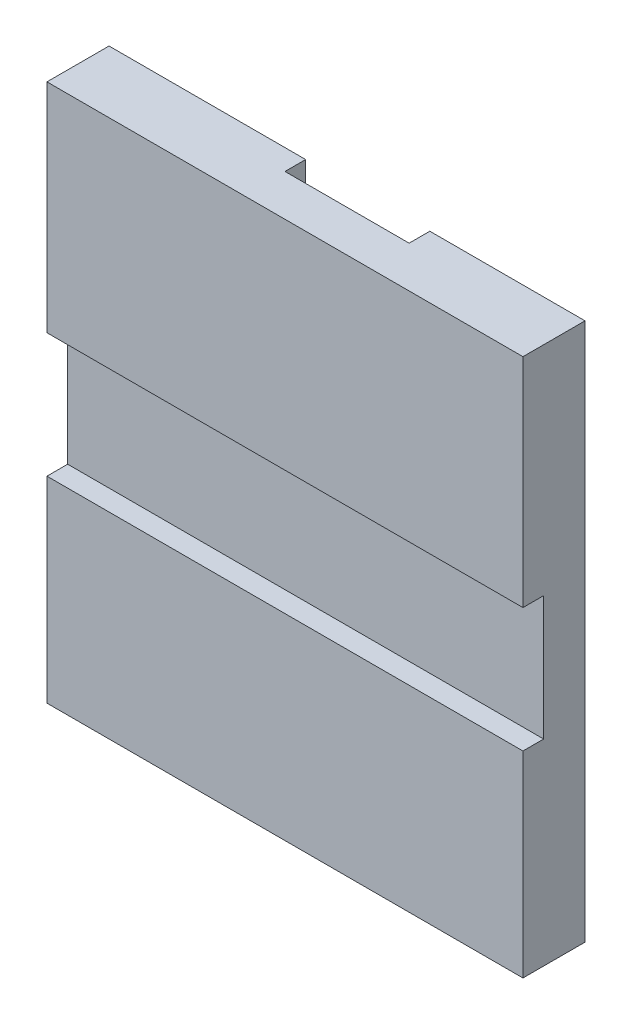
from build123d import *

# Parameters (mm, degrees)
ESQUISSE1_W             = 460
ESQUISSE1_H             = 520
EXTRUSION1_DEPTH        = 60
ESQUISSE2_W             = 120
ESQUISSE2_H             = 520
ENL_V_MAT_EXTRU_1_DEPTH = 20
ESQUISSE3_W             = 460
ESQUISSE3_H             = 120
ENL_V_MAT_EXTRU_2_DEPTH = 20


with BuildPart() as part:
    # Esquisse1 → Extrusion1 (new body)
    with BuildSketch(Plane.XY):
        with Locations((230, 260)):
            Rectangle(ESQUISSE1_W, ESQUISSE1_H)
    extrude(amount=EXTRUSION1_DEPTH)

    # Esquisse2 → Enl_v. mat.-Extru.1 (cut)
    with BuildSketch(Plane(origin=(0, 0, 0), x_dir=(-1, 0, 0), z_dir=(0, 0, -1))):
        with Locations((-250, 260)):
            Rectangle(ESQUISSE2_W, ESQUISSE2_H)
    extrude(amount=-ENL_V_MAT_EXTRU_1_DEPTH, mode=Mode.SUBTRACT)

    # Esquisse3 → Enl_v. mat.-Extru.2 (cut)
    with BuildSketch(Plane.XY.offset(60)):
        with Locations((230, 250)):
            Rectangle(ESQUISSE3_W, ESQUISSE3_H)
    extrude(amount=-ENL_V_MAT_EXTRU_2_DEPTH, mode=Mode.SUBTRACT)


solid = part.part
